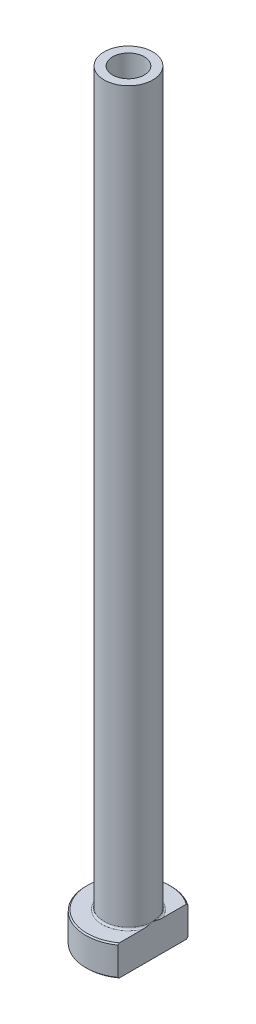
from build123d import *

# Parameters (mm, degrees)
FILLET1_R          = 0.3
CHAMFER1_SIZE      = 0.2
CUT_EXTRUDE1_DEPTH = 126.391387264
CHAMFER2_SIZE      = 0.5


with BuildPart() as part:
    # Sketch1 → Revolve1 (revolve)
    with BuildSketch(Plane.XY, mode=Mode.PRIVATE) as revolve1_sk:
        Polygon((-2.6, 125), (-4, 125), (-4, 5), (-7, 5), (-7, 0), (-2.85, 0), (-2.85, 68), (-2.6, 80), align=None)
    revolve(revolve1_sk.sketch.rotate(Axis((0, 92.187680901, 0), (0, -1, 0)), 270), axis=Axis((0, 92.187680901, 0), (0, -1, 0)))

    # Fillet1
    fillet1_edges = [part.edges().sort_by_distance(p)[0] for p in [
        (0, 5, -4),
    ]]
    fillet(fillet1_edges, radius=FILLET1_R)

    # Chamfer1
    chamfer1_edges = [part.edges().sort_by_distance(p)[0] for p in [
        (0, 0, -7),
        (0, 5, -7),
    ]]
    chamfer(chamfer1_edges, length=CHAMFER1_SIZE)

    # Sketch2 → Cut-Extrude1 (cut, through all)
    with BuildSketch(Plane.XZ):
        with BuildLine():
            Line((4, 5.744562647), (4, -5.744562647))
            ThreePointArc((4, -5.744562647), (7, 0), (4, 5.744562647))
        make_face()
    extrude(amount=-CUT_EXTRUDE1_DEPTH, mode=Mode.SUBTRACT)

    # Chamfer2
    chamfer2_edges = [part.edges().sort_by_distance(p)[0] for p in [
        (0, 0, -2.85),
    ]]
    chamfer(chamfer2_edges, length=CHAMFER2_SIZE)


solid = part.part
